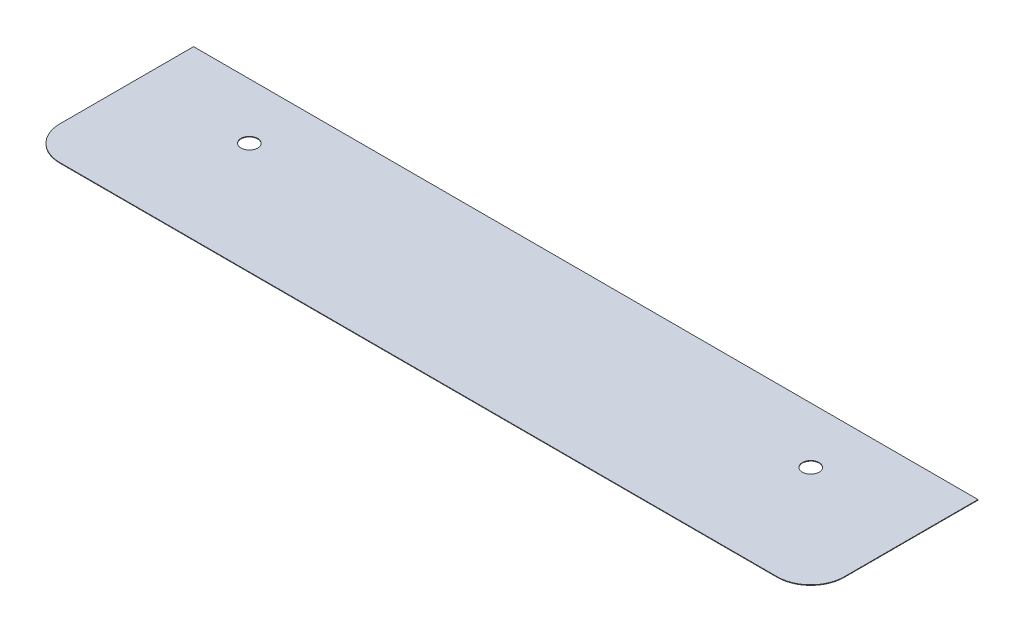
ISO-10303-21;
HEADER;
FILE_DESCRIPTION(('STEP AP214'),'2;1');
FILE_NAME('part.step','',(''),(''),'','','');
FILE_SCHEMA(('AUTOMOTIVE_DESIGN { 1 0 10303 214 1 1 1 1 }'));
ENDSEC;
DATA;
#1=APPLICATION_CONTEXT('core data for automotive mechanical design processes');
#2=APPLICATION_PROTOCOL_DEFINITION('international standard','automotive_design',2000,#1);
#3=PRODUCT_CONTEXT('',#1,'mechanical');
#4=PRODUCT('Part','Part','',(#3));
#5=PRODUCT_RELATED_PRODUCT_CATEGORY('part','',(#4));
#6=PRODUCT_DEFINITION_FORMATION('','',#4);
#7=PRODUCT_DEFINITION_CONTEXT('part definition',#1,'design');
#8=PRODUCT_DEFINITION('design','',#6,#7);
#9=PRODUCT_DEFINITION_SHAPE('','',#8);
#10=(LENGTH_UNIT() NAMED_UNIT(*) SI_UNIT(.MILLI.,.METRE.));
#11=(NAMED_UNIT(*) PLANE_ANGLE_UNIT() SI_UNIT($,.RADIAN.));
#12=(NAMED_UNIT(*) SI_UNIT($,.STERADIAN.) SOLID_ANGLE_UNIT());
#13=UNCERTAINTY_MEASURE_WITH_UNIT(LENGTH_MEASURE(1.E-05),#10,'distance_accuracy_value','');
#14=(GEOMETRIC_REPRESENTATION_CONTEXT(3) GLOBAL_UNCERTAINTY_ASSIGNED_CONTEXT((#13)) GLOBAL_UNIT_ASSIGNED_CONTEXT((#10,
#11,#12)) REPRESENTATION_CONTEXT('',''));
#15=CARTESIAN_POINT('',(0.,0.,0.));
#16=DIRECTION('',(0.,0.,1.));
#17=DIRECTION('',(1.,0.,0.));
#18=AXIS2_PLACEMENT_3D('',#15,#16,#17);
#19=CARTESIAN_POINT('',(0.,2.54,0.));
#20=DIRECTION('',(0.,0.,-1.));
#21=DIRECTION('',(-1.,0.,0.));
#22=AXIS2_PLACEMENT_3D('',#19,#20,#21);
#23=PLANE('',#22);
#24=DIRECTION('',(0.,1.,0.));
#25=VECTOR('',#24,1.);
#26=CARTESIAN_POINT('',(3421.38,0.,-4.00334589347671E-13));
#27=LINE('',#26,#25);
#28=CARTESIAN_POINT('',(3421.38,0.,0.));
#29=VERTEX_POINT('',#28);
#30=CARTESIAN_POINT('',(3421.38,2.54,-4.00334589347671E-13));
#31=VERTEX_POINT('',#30);
#32=EDGE_CURVE('E48',#29,#31,#27,.T.);
#33=ORIENTED_EDGE('',*,*,#32,.T.);
#34=DIRECTION('',(1.,0.,0.));
#35=VECTOR('',#34,1.);
#36=CARTESIAN_POINT('',(0.,2.54,0.));
#37=LINE('',#36,#35);
#38=CARTESIAN_POINT('',(152.4,2.54,0.));
#39=VERTEX_POINT('',#38);
#40=EDGE_CURVE('E122',#39,#31,#37,.T.);
#41=ORIENTED_EDGE('',*,*,#40,.F.);
#42=DIRECTION('',(0.,1.,0.));
#43=VECTOR('',#42,1.);
#44=CARTESIAN_POINT('',(152.4,0.,0.));
#45=LINE('',#44,#43);
#46=CARTESIAN_POINT('',(152.4,0.,0.));
#47=VERTEX_POINT('',#46);
#48=EDGE_CURVE('E125',#47,#39,#45,.T.);
#49=ORIENTED_EDGE('',*,*,#48,.F.);
#50=DIRECTION('',(1.,0.,0.));
#51=VECTOR('',#50,1.);
#52=CARTESIAN_POINT('',(0.,0.,0.));
#53=LINE('',#52,#51);
#54=EDGE_CURVE('E105',#47,#29,#53,.T.);
#55=ORIENTED_EDGE('',*,*,#54,.T.);
#56=EDGE_LOOP('',(#33,#41,#49,#55));
#57=FACE_BOUND('',#56,.T.);
#58=ADVANCED_FACE('F33',(#57),#23,.F.);
#59=CARTESIAN_POINT('',(0.,2.54,0.));
#60=DIRECTION('',(1.,0.,0.));
#61=DIRECTION('',(0.,0.,-1.));
#62=AXIS2_PLACEMENT_3D('',#59,#60,#61);
#63=PLANE('',#62);
#64=DIRECTION('',(0.,1.,0.));
#65=VECTOR('',#64,1.);
#66=CARTESIAN_POINT('',(0.,0.,-152.4));
#67=LINE('',#66,#65);
#68=CARTESIAN_POINT('',(0.,0.,-152.4));
#69=VERTEX_POINT('',#68);
#70=CARTESIAN_POINT('',(0.,2.54,-152.4));
#71=VERTEX_POINT('',#70);
#72=EDGE_CURVE('E56',#69,#71,#67,.T.);
#73=ORIENTED_EDGE('',*,*,#72,.T.);
#74=DIRECTION('',(0.,0.,1.));
#75=VECTOR('',#74,1.);
#76=CARTESIAN_POINT('',(0.,2.54,0.));
#77=LINE('',#76,#75);
#78=CARTESIAN_POINT('',(0.,2.54,-762.));
#79=VERTEX_POINT('',#78);
#80=EDGE_CURVE('E107',#79,#71,#77,.T.);
#81=ORIENTED_EDGE('',*,*,#80,.F.);
#82=DIRECTION('',(0.,-1.,0.));
#83=VECTOR('',#82,1.);
#84=CARTESIAN_POINT('',(0.,2.54,-762.));
#85=LINE('',#84,#83);
#86=CARTESIAN_POINT('',(0.,0.,-762.));
#87=VERTEX_POINT('',#86);
#88=EDGE_CURVE('E41',#79,#87,#85,.T.);
#89=ORIENTED_EDGE('',*,*,#88,.T.);
#90=DIRECTION('',(0.,0.,1.));
#91=VECTOR('',#90,1.);
#92=CARTESIAN_POINT('',(0.,0.,0.));
#93=LINE('',#92,#91);
#94=EDGE_CURVE('E109',#87,#69,#93,.T.);
#95=ORIENTED_EDGE('',*,*,#94,.T.);
#96=EDGE_LOOP('',(#73,#81,#89,#95));
#97=FACE_BOUND('',#96,.T.);
#98=ADVANCED_FACE('F35',(#97),#63,.F.);
#99=CARTESIAN_POINT('',(3573.78,2.54,0.));
#100=DIRECTION('',(-1.,0.,0.));
#101=DIRECTION('',(0.,0.,1.));
#102=AXIS2_PLACEMENT_3D('',#99,#100,#101);
#103=PLANE('',#102);
#104=DIRECTION('',(0.,0.,-1.));
#105=VECTOR('',#104,1.);
#106=CARTESIAN_POINT('',(3573.78,2.54,0.));
#107=LINE('',#106,#105);
#108=CARTESIAN_POINT('',(3573.78,2.54,-152.4));
#109=VERTEX_POINT('',#108);
#110=CARTESIAN_POINT('',(3573.78,2.54,-762.));
#111=VERTEX_POINT('',#110);
#112=EDGE_CURVE('E99',#109,#111,#107,.T.);
#113=ORIENTED_EDGE('',*,*,#112,.F.);
#114=DIRECTION('',(0.,1.,0.));
#115=VECTOR('',#114,1.);
#116=CARTESIAN_POINT('',(3573.78,0.,-152.4));
#117=LINE('',#116,#115);
#118=CARTESIAN_POINT('',(3573.78,0.,-152.4));
#119=VERTEX_POINT('',#118);
#120=EDGE_CURVE('E86',#119,#109,#117,.T.);
#121=ORIENTED_EDGE('',*,*,#120,.F.);
#122=DIRECTION('',(0.,0.,-1.));
#123=VECTOR('',#122,1.);
#124=CARTESIAN_POINT('',(3573.78,0.,0.));
#125=LINE('',#124,#123);
#126=CARTESIAN_POINT('',(3573.78,0.,-762.));
#127=VERTEX_POINT('',#126);
#128=EDGE_CURVE('E98',#119,#127,#125,.T.);
#129=ORIENTED_EDGE('',*,*,#128,.T.);
#130=DIRECTION('',(0.,-1.,0.));
#131=VECTOR('',#130,1.);
#132=CARTESIAN_POINT('',(3573.78,2.54,-762.));
#133=LINE('',#132,#131);
#134=EDGE_CURVE('E11',#111,#127,#133,.T.);
#135=ORIENTED_EDGE('',*,*,#134,.F.);
#136=EDGE_LOOP('',(#113,#121,#129,#135));
#137=FACE_BOUND('',#136,.T.);
#138=ADVANCED_FACE('F96',(#137),#103,.F.);
#139=CARTESIAN_POINT('',(0.,2.54,-762.));
#140=DIRECTION('',(0.,0.,1.));
#141=DIRECTION('',(1.,0.,0.));
#142=AXIS2_PLACEMENT_3D('',#139,#140,#141);
#143=PLANE('',#142);
#144=DIRECTION('',(-1.,0.,0.));
#145=VECTOR('',#144,1.);
#146=CARTESIAN_POINT('',(0.,0.,-762.));
#147=LINE('',#146,#145);
#148=EDGE_CURVE('E104',#127,#87,#147,.T.);
#149=ORIENTED_EDGE('',*,*,#148,.T.);
#150=ORIENTED_EDGE('',*,*,#88,.F.);
#151=DIRECTION('',(-1.,0.,0.));
#152=VECTOR('',#151,1.);
#153=CARTESIAN_POINT('',(0.,2.54,-762.));
#154=LINE('',#153,#152);
#155=EDGE_CURVE('E113',#111,#79,#154,.T.);
#156=ORIENTED_EDGE('',*,*,#155,.F.);
#157=ORIENTED_EDGE('',*,*,#134,.T.);
#158=EDGE_LOOP('',(#149,#150,#156,#157));
#159=FACE_BOUND('',#158,.T.);
#160=ADVANCED_FACE('F160',(#159),#143,.F.);
#161=CARTESIAN_POINT('',(0.,2.54,0.));
#162=DIRECTION('',(0.,-1.,0.));
#163=DIRECTION('',(0.,0.,-1.));
#164=AXIS2_PLACEMENT_3D('',#161,#162,#163);
#165=PLANE('',#164);
#166=CARTESIAN_POINT('',(3065.78,2.54,-508.));
#167=DIRECTION('',(0.,1.,0.));
#168=DIRECTION('',(0.,0.,-1.));
#169=AXIS2_PLACEMENT_3D('',#166,#167,#168);
#170=CIRCLE('',#169,38.0999999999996);
#171=CARTESIAN_POINT('',(3065.78,2.54,-546.1));
#172=VERTEX_POINT('',#171);
#173=EDGE_CURVE('E170',#172,#172,#170,.T.);
#174=ORIENTED_EDGE('',*,*,#173,.F.);
#175=EDGE_LOOP('',(#174));
#176=FACE_BOUND('',#175,.T.);
#177=CARTESIAN_POINT('',(508.,2.54,-508.));
#178=DIRECTION('',(0.,1.,0.));
#179=DIRECTION('',(0.,0.,1.));
#180=AXIS2_PLACEMENT_3D('',#177,#178,#179);
#181=CIRCLE('',#180,38.1);
#182=CARTESIAN_POINT('',(508.,2.54,-469.9));
#183=VERTEX_POINT('',#182);
#184=EDGE_CURVE('E173',#183,#183,#181,.T.);
#185=ORIENTED_EDGE('',*,*,#184,.F.);
#186=EDGE_LOOP('',(#185));
#187=FACE_BOUND('',#186,.T.);
#188=ORIENTED_EDGE('',*,*,#40,.T.);
#189=CARTESIAN_POINT('',(3421.38,2.54,-152.4));
#190=DIRECTION('',(0.,-1.,0.));
#191=DIRECTION('',(0.,0.,-1.));
#192=AXIS2_PLACEMENT_3D('',#189,#190,#191);
#193=CIRCLE('',#192,152.4);
#194=EDGE_CURVE('E92',#109,#31,#193,.T.);
#195=ORIENTED_EDGE('',*,*,#194,.F.);
#196=ORIENTED_EDGE('',*,*,#112,.T.);
#197=ORIENTED_EDGE('',*,*,#155,.T.);
#198=ORIENTED_EDGE('',*,*,#80,.T.);
#199=CARTESIAN_POINT('',(152.4,2.54,-152.4));
#200=DIRECTION('',(0.,-1.,0.));
#201=DIRECTION('',(0.,0.,1.));
#202=AXIS2_PLACEMENT_3D('',#199,#200,#201);
#203=CIRCLE('',#202,152.4);
#204=EDGE_CURVE('E132',#39,#71,#203,.T.);
#205=ORIENTED_EDGE('',*,*,#204,.F.);
#206=EDGE_LOOP('',(#188,#195,#196,#197,#198,#205));
#207=FACE_BOUND('',#206,.T.);
#208=ADVANCED_FACE('F137',(#176,#187,#207),#165,.F.);
#209=CARTESIAN_POINT('',(0.,0.,0.));
#210=DIRECTION('',(0.,-1.,0.));
#211=DIRECTION('',(0.,0.,-1.));
#212=AXIS2_PLACEMENT_3D('',#209,#210,#211);
#213=PLANE('',#212);
#214=CARTESIAN_POINT('',(3065.78,0.,-508.));
#215=DIRECTION('',(0.,1.,0.));
#216=DIRECTION('',(0.,0.,-1.));
#217=AXIS2_PLACEMENT_3D('',#214,#215,#216);
#218=CIRCLE('',#217,38.0999999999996);
#219=CARTESIAN_POINT('',(3065.78,0.,-546.1));
#220=VERTEX_POINT('',#219);
#221=EDGE_CURVE('E176',#220,#220,#218,.T.);
#222=ORIENTED_EDGE('',*,*,#221,.T.);
#223=EDGE_LOOP('',(#222));
#224=FACE_BOUND('',#223,.T.);
#225=CARTESIAN_POINT('',(508.,0.,-508.));
#226=DIRECTION('',(0.,1.,0.));
#227=DIRECTION('',(0.,0.,1.));
#228=AXIS2_PLACEMENT_3D('',#225,#226,#227);
#229=CIRCLE('',#228,38.1);
#230=CARTESIAN_POINT('',(508.,0.,-469.9));
#231=VERTEX_POINT('',#230);
#232=EDGE_CURVE('E175',#231,#231,#229,.T.);
#233=ORIENTED_EDGE('',*,*,#232,.T.);
#234=EDGE_LOOP('',(#233));
#235=FACE_BOUND('',#234,.T.);
#236=CARTESIAN_POINT('',(3421.38,0.,-152.4));
#237=DIRECTION('',(0.,-1.,0.));
#238=DIRECTION('',(0.,0.,-1.));
#239=AXIS2_PLACEMENT_3D('',#236,#237,#238);
#240=CIRCLE('',#239,152.4);
#241=EDGE_CURVE('E83',#119,#29,#240,.T.);
#242=ORIENTED_EDGE('',*,*,#241,.T.);
#243=ORIENTED_EDGE('',*,*,#54,.F.);
#244=CARTESIAN_POINT('',(152.4,0.,-152.4));
#245=DIRECTION('',(0.,-1.,0.));
#246=DIRECTION('',(0.,0.,1.));
#247=AXIS2_PLACEMENT_3D('',#244,#245,#246);
#248=CIRCLE('',#247,152.4);
#249=EDGE_CURVE('E129',#47,#69,#248,.T.);
#250=ORIENTED_EDGE('',*,*,#249,.T.);
#251=ORIENTED_EDGE('',*,*,#94,.F.);
#252=ORIENTED_EDGE('',*,*,#148,.F.);
#253=ORIENTED_EDGE('',*,*,#128,.F.);
#254=EDGE_LOOP('',(#242,#243,#250,#251,#252,#253));
#255=FACE_BOUND('',#254,.T.);
#256=ADVANCED_FACE('F102',(#224,#235,#255),#213,.T.);
#257=CARTESIAN_POINT('',(152.4,0.,-152.4));
#258=DIRECTION('',(0.,1.,0.));
#259=DIRECTION('',(0.,0.,1.));
#260=AXIS2_PLACEMENT_3D('',#257,#258,#259);
#261=CYLINDRICAL_SURFACE('',#260,152.4);
#262=ORIENTED_EDGE('',*,*,#204,.T.);
#263=ORIENTED_EDGE('',*,*,#72,.F.);
#264=ORIENTED_EDGE('',*,*,#249,.F.);
#265=ORIENTED_EDGE('',*,*,#48,.T.);
#266=EDGE_LOOP('',(#262,#263,#264,#265));
#267=FACE_BOUND('',#266,.T.);
#268=ADVANCED_FACE('F141',(#267),#261,.T.);
#269=CARTESIAN_POINT('',(3421.38,0.,-152.4));
#270=DIRECTION('',(0.,1.,0.));
#271=DIRECTION('',(0.,0.,1.));
#272=AXIS2_PLACEMENT_3D('',#269,#270,#271);
#273=CYLINDRICAL_SURFACE('',#272,152.4);
#274=ORIENTED_EDGE('',*,*,#194,.T.);
#275=ORIENTED_EDGE('',*,*,#32,.F.);
#276=ORIENTED_EDGE('',*,*,#241,.F.);
#277=ORIENTED_EDGE('',*,*,#120,.T.);
#278=EDGE_LOOP('',(#274,#275,#276,#277));
#279=FACE_BOUND('',#278,.T.);
#280=ADVANCED_FACE('F85',(#279),#273,.T.);
#281=CARTESIAN_POINT('',(508.,0.,-508.));
#282=DIRECTION('',(0.,1.,0.));
#283=DIRECTION('',(0.,0.,1.));
#284=AXIS2_PLACEMENT_3D('',#281,#282,#283);
#285=CYLINDRICAL_SURFACE('',#284,38.1);
#286=ORIENTED_EDGE('',*,*,#232,.F.);
#287=EDGE_LOOP('',(#286));
#288=FACE_BOUND('',#287,.T.);
#289=ORIENTED_EDGE('',*,*,#184,.T.);
#290=EDGE_LOOP('',(#289));
#291=FACE_BOUND('',#290,.T.);
#292=ADVANCED_FACE('F148',(#288,#291),#285,.F.);
#293=CARTESIAN_POINT('',(3065.78,0.,-508.));
#294=DIRECTION('',(0.,1.,0.));
#295=DIRECTION('',(0.,0.,1.));
#296=AXIS2_PLACEMENT_3D('',#293,#294,#295);
#297=CYLINDRICAL_SURFACE('',#296,38.0999999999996);
#298=ORIENTED_EDGE('',*,*,#221,.F.);
#299=EDGE_LOOP('',(#298));
#300=FACE_BOUND('',#299,.T.);
#301=ORIENTED_EDGE('',*,*,#173,.T.);
#302=EDGE_LOOP('',(#301));
#303=FACE_BOUND('',#302,.T.);
#304=ADVANCED_FACE('F184',(#300,#303),#297,.F.);
#305=CLOSED_SHELL('',(#58,#98,#138,#160,#208,#256,#268,#280,#292,#304));
#306=MANIFOLD_SOLID_BREP('B2',#305);
#307=ADVANCED_BREP_SHAPE_REPRESENTATION('',(#18,#306),#14);
#308=SHAPE_DEFINITION_REPRESENTATION(#9,#307);
ENDSEC;
END-ISO-10303-21;
